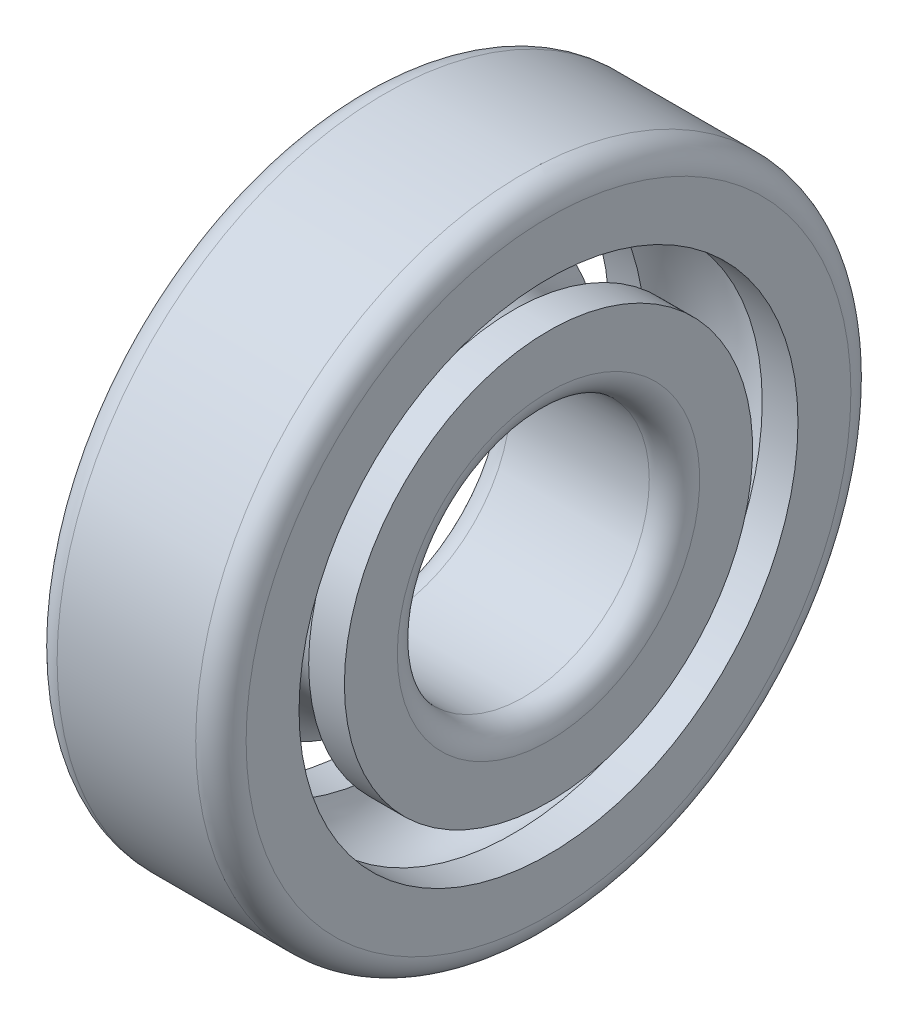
ISO-10303-21;
HEADER;
FILE_DESCRIPTION(('STEP AP214'),'2;1');
FILE_NAME('part.step','',(''),(''),'','','');
FILE_SCHEMA(('AUTOMOTIVE_DESIGN { 1 0 10303 214 1 1 1 1 }'));
ENDSEC;
DATA;
#1=APPLICATION_CONTEXT('core data for automotive mechanical design processes');
#2=APPLICATION_PROTOCOL_DEFINITION('international standard','automotive_design',2000,#1);
#3=PRODUCT_CONTEXT('',#1,'mechanical');
#4=PRODUCT('Part','Part','',(#3));
#5=PRODUCT_RELATED_PRODUCT_CATEGORY('part','',(#4));
#6=PRODUCT_DEFINITION_FORMATION('','',#4);
#7=PRODUCT_DEFINITION_CONTEXT('part definition',#1,'design');
#8=PRODUCT_DEFINITION('design','',#6,#7);
#9=PRODUCT_DEFINITION_SHAPE('','',#8);
#10=(LENGTH_UNIT() NAMED_UNIT(*) SI_UNIT(.MILLI.,.METRE.));
#11=(NAMED_UNIT(*) PLANE_ANGLE_UNIT() SI_UNIT($,.RADIAN.));
#12=(NAMED_UNIT(*) SI_UNIT($,.STERADIAN.) SOLID_ANGLE_UNIT());
#13=UNCERTAINTY_MEASURE_WITH_UNIT(LENGTH_MEASURE(1.E-05),#10,'distance_accuracy_value','');
#14=(GEOMETRIC_REPRESENTATION_CONTEXT(3) GLOBAL_UNCERTAINTY_ASSIGNED_CONTEXT((#13)) GLOBAL_UNIT_ASSIGNED_CONTEXT((#10,
#11,#12)) REPRESENTATION_CONTEXT('',''));
#15=CARTESIAN_POINT('',(0.,0.,0.));
#16=DIRECTION('',(0.,0.,1.));
#17=DIRECTION('',(1.,0.,0.));
#18=AXIS2_PLACEMENT_3D('',#15,#16,#17);
#19=CARTESIAN_POINT('',(2.74999999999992,0.,3.33066907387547E-13));
#20=DIRECTION('',(-1.,0.,0.));
#21=DIRECTION('',(0.,0.,1.));
#22=AXIS2_PLACEMENT_3D('',#19,#20,#21);
#23=TOROIDAL_SURFACE('',#22,12.,1.);
#24=CARTESIAN_POINT('',(2.74999999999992,0.,3.33066907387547E-13));
#25=DIRECTION('',(-1.,0.,0.));
#26=DIRECTION('',(0.,0.,1.));
#27=AXIS2_PLACEMENT_3D('',#24,#25,#26);
#28=CIRCLE('',#27,13.);
#29=CARTESIAN_POINT('',(2.74999999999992,0.,13.0000000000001));
#30=VERTEX_POINT('',#29);
#31=EDGE_CURVE('E11',#30,#30,#28,.T.);
#32=ORIENTED_EDGE('',*,*,#31,.F.);
#33=EDGE_LOOP('',(#32));
#34=FACE_BOUND('',#33,.T.);
#35=CARTESIAN_POINT('',(3.74999999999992,-1.11022302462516E-13,2.22044604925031E-13));
#36=DIRECTION('',(-1.,0.,0.));
#37=DIRECTION('',(0.,0.,1.));
#38=AXIS2_PLACEMENT_3D('',#35,#36,#37);
#39=CIRCLE('',#38,12.);
#40=CARTESIAN_POINT('',(3.74999999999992,-1.11224614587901E-13,12.0000000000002));
#41=VERTEX_POINT('',#40);
#42=EDGE_CURVE('E64',#41,#41,#39,.T.);
#43=ORIENTED_EDGE('',*,*,#42,.T.);
#44=EDGE_LOOP('',(#43));
#45=FACE_BOUND('',#44,.T.);
#46=ADVANCED_FACE('F36',(#34,#45),#23,.T.);
#47=CARTESIAN_POINT('',(-1.26513430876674,0.,1.11022302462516E-13));
#48=DIRECTION('',(-1.,0.,0.));
#49=DIRECTION('',(0.,0.,1.));
#50=AXIS2_PLACEMENT_3D('',#47,#48,#49);
#51=CYLINDRICAL_SURFACE('',#50,13.);
#52=CARTESIAN_POINT('',(-2.75000000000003,0.,1.11022302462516E-13));
#53=DIRECTION('',(-1.,0.,0.));
#54=DIRECTION('',(0.,0.,1.));
#55=AXIS2_PLACEMENT_3D('',#52,#53,#54);
#56=CIRCLE('',#55,13.);
#57=CARTESIAN_POINT('',(-2.75000000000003,0.,13.0000000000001));
#58=VERTEX_POINT('',#57);
#59=EDGE_CURVE('E42',#58,#58,#56,.T.);
#60=CARTESIAN_POINT('',(-2.75000000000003,0.,13.0000000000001));
#61=CARTESIAN_POINT('',(-2.69270833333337,0.,13.0000000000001));
#62=CARTESIAN_POINT('',(-2.6354166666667,0.,13.0000000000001));
#63=CARTESIAN_POINT('',(-2.52083333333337,0.,13.0000000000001));
#64=CARTESIAN_POINT('',(-2.4635416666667,0.,13.0000000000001));
#65=CARTESIAN_POINT('',(-2.34895833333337,0.,13.0000000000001));
#66=CARTESIAN_POINT('',(-2.2916666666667,0.,13.0000000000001));
#67=CARTESIAN_POINT('',(-2.17708333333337,0.,13.0000000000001));
#68=CARTESIAN_POINT('',(-2.1197916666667,0.,13.0000000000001));
#69=CARTESIAN_POINT('',(-2.00520833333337,0.,13.0000000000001));
#70=CARTESIAN_POINT('',(-1.94791666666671,0.,13.0000000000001));
#71=CARTESIAN_POINT('',(-1.83333333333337,0.,13.0000000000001));
#72=CARTESIAN_POINT('',(-1.77604166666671,0.,13.0000000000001));
#73=CARTESIAN_POINT('',(-1.66145833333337,0.,13.0000000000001));
#74=CARTESIAN_POINT('',(-1.60416666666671,0.,13.0000000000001));
#75=CARTESIAN_POINT('',(-1.48958333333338,0.,13.0000000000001));
#76=CARTESIAN_POINT('',(-1.43229166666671,0.,13.0000000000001));
#77=CARTESIAN_POINT('',(-1.31770833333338,0.,13.0000000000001));
#78=CARTESIAN_POINT('',(-1.26041666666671,0.,13.0000000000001));
#79=CARTESIAN_POINT('',(-1.14583333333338,0.,13.0000000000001));
#80=CARTESIAN_POINT('',(-1.08854166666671,0.,13.0000000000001));
#81=CARTESIAN_POINT('',(-0.973958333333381,0.,13.0000000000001));
#82=CARTESIAN_POINT('',(-0.916666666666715,0.,13.0000000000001));
#83=CARTESIAN_POINT('',(-0.802083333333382,0.,13.0000000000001));
#84=CARTESIAN_POINT('',(-0.744791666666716,0.,13.0000000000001));
#85=CARTESIAN_POINT('',(-0.630208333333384,0.,13.0000000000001));
#86=CARTESIAN_POINT('',(-0.572916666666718,0.,13.0000000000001));
#87=CARTESIAN_POINT('',(-0.458333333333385,0.,13.0000000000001));
#88=CARTESIAN_POINT('',(-0.401041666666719,0.,13.0000000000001));
#89=CARTESIAN_POINT('',(-0.286458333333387,0.,13.0000000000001));
#90=CARTESIAN_POINT('',(-0.229166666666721,0.,13.0000000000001));
#91=CARTESIAN_POINT('',(-0.114583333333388,0.,13.0000000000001));
#92=CARTESIAN_POINT('',(-0.0572916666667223,0.,13.0000000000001));
#93=CARTESIAN_POINT('',(0.05729166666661,0.,13.0000000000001));
#94=CARTESIAN_POINT('',(0.114583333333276,0.,13.0000000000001));
#95=CARTESIAN_POINT('',(0.229166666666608,0.,13.0000000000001));
#96=CARTESIAN_POINT('',(0.286458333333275,0.,13.0000000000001));
#97=CARTESIAN_POINT('',(0.401041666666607,0.,13.0000000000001));
#98=CARTESIAN_POINT('',(0.458333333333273,0.,13.0000000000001));
#99=CARTESIAN_POINT('',(0.572916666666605,0.,13.0000000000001));
#100=CARTESIAN_POINT('',(0.630208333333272,0.,13.0000000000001));
#101=CARTESIAN_POINT('',(0.744791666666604,0.,13.0000000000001));
#102=CARTESIAN_POINT('',(0.80208333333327,0.,13.0000000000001));
#103=CARTESIAN_POINT('',(0.916666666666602,0.,13.0000000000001));
#104=CARTESIAN_POINT('',(0.973958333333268,0.,13.0000000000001));
#105=CARTESIAN_POINT('',(1.0885416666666,0.,13.0000000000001));
#106=CARTESIAN_POINT('',(1.14583333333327,0.,13.0000000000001));
#107=CARTESIAN_POINT('',(1.2604166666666,0.,13.0000000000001));
#108=CARTESIAN_POINT('',(1.31770833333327,0.,13.0000000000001));
#109=CARTESIAN_POINT('',(1.4322916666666,0.,13.0000000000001));
#110=CARTESIAN_POINT('',(1.48958333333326,0.,13.0000000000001));
#111=CARTESIAN_POINT('',(1.6041666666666,0.,13.0000000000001));
#112=CARTESIAN_POINT('',(1.66145833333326,0.,13.0000000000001));
#113=CARTESIAN_POINT('',(1.77604166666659,0.,13.0000000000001));
#114=CARTESIAN_POINT('',(1.83333333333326,0.,13.0000000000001));
#115=CARTESIAN_POINT('',(1.94791666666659,0.,13.0000000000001));
#116=CARTESIAN_POINT('',(2.00520833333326,0.,13.0000000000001));
#117=CARTESIAN_POINT('',(2.11979166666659,0.,13.0000000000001));
#118=CARTESIAN_POINT('',(2.17708333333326,0.,13.0000000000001));
#119=CARTESIAN_POINT('',(2.29166666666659,0.,13.0000000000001));
#120=CARTESIAN_POINT('',(2.34895833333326,0.,13.0000000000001));
#121=CARTESIAN_POINT('',(2.46354166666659,0.,13.0000000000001));
#122=CARTESIAN_POINT('',(2.52083333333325,0.,13.0000000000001));
#123=CARTESIAN_POINT('',(2.63541666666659,0.,13.0000000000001));
#124=CARTESIAN_POINT('',(2.69270833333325,0.,13.0000000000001));
#125=CARTESIAN_POINT('',(2.74999999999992,0.,13.0000000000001));
#126=B_SPLINE_CURVE_WITH_KNOTS('',3,(#60,#61,#62,#63,#64,#65,#66,#67,#68,#69,#70,#71,#72,#73,
#74,#75,#76,#77,#78,#79,#80,#81,#82,#83,#84,#85,#86,#87,#88,#89,#90,#91,#92,#93,#94,#95,#96,#97,
#98,#99,#100,#101,#102,#103,#104,#105,#106,#107,#108,#109,#110,#111,#112,#113,#114,#115,#116,
#117,#118,#119,#120,#121,#122,#123,#124,#125),.UNSPECIFIED.,.F.,.F.,(4,2,2,2,2,2,2,2,2,2,2,2,2,
2,2,2,2,2,2,2,2,2,2,2,2,2,2,2,2,2,2,2,4),(0.,0.171874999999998,0.343749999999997,
0.515624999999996,0.687499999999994,0.859374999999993,1.03124999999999,1.20312499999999,
1.37499999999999,1.54687499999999,1.71874999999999,1.89062499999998,2.06249999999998,
2.23437499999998,2.40624999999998,2.57812499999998,2.74999999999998,2.92187499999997,
3.09374999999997,3.26562499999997,3.43749999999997,3.60937499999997,3.78124999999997,
3.95312499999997,4.12499999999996,4.29687499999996,4.46874999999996,4.64062499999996,
4.81249999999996,4.98437499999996,5.15624999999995,5.32812499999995,5.49999999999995),.UNSPECIFIED.);
#127=EDGE_CURVE('BSEAM101',#58,#30,#126,.T.);
#128=ORIENTED_EDGE('',*,*,#59,.F.);
#129=ORIENTED_EDGE('',*,*,#31,.T.);
#130=ORIENTED_EDGE('',*,*,#127,.T.);
#131=ORIENTED_EDGE('',*,*,#127,.F.);
#132=EDGE_LOOP('',(#128,#130,#129,#131));
#133=FACE_BOUND('',#132,.T.);
#134=ADVANCED_FACE('F101',(#133),#51,.T.);
#135=CARTESIAN_POINT('',(-2.75000000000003,0.,1.11022302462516E-13));
#136=DIRECTION('',(-1.,0.,0.));
#137=DIRECTION('',(0.,0.,1.));
#138=AXIS2_PLACEMENT_3D('',#135,#136,#137);
#139=TOROIDAL_SURFACE('',#138,12.,1.);
#140=CARTESIAN_POINT('',(-3.74999999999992,0.,1.11022302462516E-13));
#141=DIRECTION('',(-1.,0.,0.));
#142=DIRECTION('',(0.,0.,1.));
#143=AXIS2_PLACEMENT_3D('',#140,#141,#142);
#144=CIRCLE('',#143,12.);
#145=CARTESIAN_POINT('',(-3.74999999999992,0.,12.0000000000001));
#146=VERTEX_POINT('',#145);
#147=EDGE_CURVE('E46',#146,#146,#144,.T.);
#148=ORIENTED_EDGE('',*,*,#147,.F.);
#149=EDGE_LOOP('',(#148));
#150=FACE_BOUND('',#149,.T.);
#151=ORIENTED_EDGE('',*,*,#59,.T.);
#152=EDGE_LOOP('',(#151));
#153=FACE_BOUND('',#152,.T.);
#154=ADVANCED_FACE('F96',(#150,#153),#139,.T.);
#155=CARTESIAN_POINT('',(-3.75000000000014,0.,-12.));
#156=DIRECTION('',(1.,0.,0.));
#157=DIRECTION('',(0.,0.,-1.));
#158=AXIS2_PLACEMENT_3D('',#155,#156,#157);
#159=PLANE('',#158);
#160=CARTESIAN_POINT('',(-3.74999999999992,0.,1.11022302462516E-13));
#161=DIRECTION('',(-1.,0.,0.));
#162=DIRECTION('',(0.,0.,1.));
#163=AXIS2_PLACEMENT_3D('',#160,#161,#162);
#164=CIRCLE('',#163,9.9);
#165=CARTESIAN_POINT('',(-3.74999999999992,0.,9.90000000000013));
#166=VERTEX_POINT('',#165);
#167=EDGE_CURVE('E50',#166,#166,#164,.T.);
#168=ORIENTED_EDGE('',*,*,#167,.F.);
#169=EDGE_LOOP('',(#168));
#170=FACE_BOUND('',#169,.T.);
#171=ORIENTED_EDGE('',*,*,#147,.T.);
#172=EDGE_LOOP('',(#171));
#173=FACE_BOUND('',#172,.T.);
#174=ADVANCED_FACE('F90',(#170,#173),#159,.F.);
#175=CARTESIAN_POINT('',(-1.26513430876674,0.,1.11022302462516E-13));
#176=DIRECTION('',(-1.,0.,0.));
#177=DIRECTION('',(0.,0.,1.));
#178=AXIS2_PLACEMENT_3D('',#175,#176,#177);
#179=CYLINDRICAL_SURFACE('',#178,9.9);
#180=CARTESIAN_POINT('',(-2.33238075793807,0.,2.22044604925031E-13));
#181=DIRECTION('',(-1.,0.,0.));
#182=DIRECTION('',(0.,0.,1.));
#183=AXIS2_PLACEMENT_3D('',#180,#181,#182);
#184=CIRCLE('',#183,9.9);
#185=CARTESIAN_POINT('',(-2.33238075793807,0.,9.90000000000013));
#186=VERTEX_POINT('',#185);
#187=EDGE_CURVE('E55',#186,#186,#184,.T.);
#188=CARTESIAN_POINT('',(-2.33238075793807,0.,9.90000000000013));
#189=CARTESIAN_POINT('',(-2.34714762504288,0.,9.90000000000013));
#190=CARTESIAN_POINT('',(-2.36191449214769,0.,9.90000000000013));
#191=CARTESIAN_POINT('',(-2.39144822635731,0.,9.90000000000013));
#192=CARTESIAN_POINT('',(-2.40621509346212,0.,9.90000000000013));
#193=CARTESIAN_POINT('',(-2.43574882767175,0.,9.90000000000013));
#194=CARTESIAN_POINT('',(-2.45051569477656,0.,9.90000000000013));
#195=CARTESIAN_POINT('',(-2.48004942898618,0.,9.90000000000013));
#196=CARTESIAN_POINT('',(-2.49481629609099,0.,9.90000000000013));
#197=CARTESIAN_POINT('',(-2.52435003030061,0.,9.90000000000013));
#198=CARTESIAN_POINT('',(-2.53911689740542,0.,9.90000000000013));
#199=CARTESIAN_POINT('',(-2.56865063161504,0.,9.90000000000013));
#200=CARTESIAN_POINT('',(-2.58341749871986,0.,9.90000000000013));
#201=CARTESIAN_POINT('',(-2.61295123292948,0.,9.90000000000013));
#202=CARTESIAN_POINT('',(-2.62771810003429,0.,9.90000000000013));
#203=CARTESIAN_POINT('',(-2.65725183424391,0.,9.90000000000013));
#204=CARTESIAN_POINT('',(-2.67201870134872,0.,9.90000000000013));
#205=CARTESIAN_POINT('',(-2.70155243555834,0.,9.90000000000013));
#206=CARTESIAN_POINT('',(-2.71631930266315,0.,9.90000000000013));
#207=CARTESIAN_POINT('',(-2.74585303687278,0.,9.90000000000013));
#208=CARTESIAN_POINT('',(-2.76061990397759,0.,9.90000000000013));
#209=CARTESIAN_POINT('',(-2.79015363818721,0.,9.90000000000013));
#210=CARTESIAN_POINT('',(-2.80492050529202,0.,9.90000000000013));
#211=CARTESIAN_POINT('',(-2.83445423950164,0.,9.90000000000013));
#212=CARTESIAN_POINT('',(-2.84922110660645,0.,9.90000000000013));
#213=CARTESIAN_POINT('',(-2.87875484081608,0.,9.90000000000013));
#214=CARTESIAN_POINT('',(-2.89352170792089,0.,9.90000000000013));
#215=CARTESIAN_POINT('',(-2.92305544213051,0.,9.90000000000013));
#216=CARTESIAN_POINT('',(-2.93782230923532,0.,9.90000000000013));
#217=CARTESIAN_POINT('',(-2.96735604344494,0.,9.90000000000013));
#218=CARTESIAN_POINT('',(-2.98212291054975,0.,9.90000000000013));
#219=CARTESIAN_POINT('',(-3.01165664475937,0.,9.90000000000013));
#220=CARTESIAN_POINT('',(-3.02642351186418,0.,9.90000000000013));
#221=CARTESIAN_POINT('',(-3.05595724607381,0.,9.90000000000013));
#222=CARTESIAN_POINT('',(-3.07072411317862,0.,9.90000000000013));
#223=CARTESIAN_POINT('',(-3.10025784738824,0.,9.90000000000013));
#224=CARTESIAN_POINT('',(-3.11502471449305,0.,9.90000000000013));
#225=CARTESIAN_POINT('',(-3.14455844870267,0.,9.90000000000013));
#226=CARTESIAN_POINT('',(-3.15932531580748,0.,9.90000000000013));
#227=CARTESIAN_POINT('',(-3.1888590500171,0.,9.90000000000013));
#228=CARTESIAN_POINT('',(-3.20362591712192,0.,9.90000000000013));
#229=CARTESIAN_POINT('',(-3.23315965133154,0.,9.90000000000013));
#230=CARTESIAN_POINT('',(-3.24792651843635,0.,9.90000000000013));
#231=CARTESIAN_POINT('',(-3.27746025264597,0.,9.90000000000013));
#232=CARTESIAN_POINT('',(-3.29222711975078,0.,9.90000000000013));
#233=CARTESIAN_POINT('',(-3.3217608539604,0.,9.90000000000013));
#234=CARTESIAN_POINT('',(-3.33652772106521,0.,9.90000000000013));
#235=CARTESIAN_POINT('',(-3.36606145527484,0.,9.90000000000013));
#236=CARTESIAN_POINT('',(-3.38082832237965,0.,9.90000000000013));
#237=CARTESIAN_POINT('',(-3.41036205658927,0.,9.90000000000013));
#238=CARTESIAN_POINT('',(-3.42512892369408,0.,9.90000000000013));
#239=CARTESIAN_POINT('',(-3.4546626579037,0.,9.90000000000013));
#240=CARTESIAN_POINT('',(-3.46942952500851,0.,9.90000000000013));
#241=CARTESIAN_POINT('',(-3.49896325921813,0.,9.90000000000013));
#242=CARTESIAN_POINT('',(-3.51373012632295,0.,9.90000000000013));
#243=CARTESIAN_POINT('',(-3.54326386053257,0.,9.90000000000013));
#244=CARTESIAN_POINT('',(-3.55803072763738,0.,9.90000000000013));
#245=CARTESIAN_POINT('',(-3.587564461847,0.,9.90000000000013));
#246=CARTESIAN_POINT('',(-3.60233132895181,0.,9.90000000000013));
#247=CARTESIAN_POINT('',(-3.63186506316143,0.,9.90000000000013));
#248=CARTESIAN_POINT('',(-3.64663193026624,0.,9.90000000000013));
#249=CARTESIAN_POINT('',(-3.67616566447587,0.,9.90000000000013));
#250=CARTESIAN_POINT('',(-3.69093253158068,0.,9.90000000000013));
#251=CARTESIAN_POINT('',(-3.7204662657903,0.,9.90000000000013));
#252=CARTESIAN_POINT('',(-3.73523313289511,0.,9.90000000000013));
#253=CARTESIAN_POINT('',(-3.74999999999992,0.,9.90000000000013));
#254=B_SPLINE_CURVE_WITH_KNOTS('',3,(#188,#189,#190,#191,#192,#193,#194,#195,#196,#197,#198,
#199,#200,#201,#202,#203,#204,#205,#206,#207,#208,#209,#210,#211,#212,#213,#214,#215,#216,#217,
#218,#219,#220,#221,#222,#223,#224,#225,#226,#227,#228,#229,#230,#231,#232,#233,#234,#235,#236,
#237,#238,#239,#240,#241,#242,#243,#244,#245,#246,#247,#248,#249,#250,#251,#252,#253),
.UNSPECIFIED.,.F.,.F.,(4,2,2,2,2,2,2,2,2,2,2,2,2,2,2,2,2,2,2,2,2,2,2,2,2,2,2,2,2,2,2,2,4),(0.,
0.0443006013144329,0.0886012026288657,0.132901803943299,0.177202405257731,0.221503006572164,
0.265803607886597,0.31010420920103,0.354404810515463,0.398705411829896,0.443006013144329,
0.487306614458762,0.531607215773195,0.575907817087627,0.62020841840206,0.664509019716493,
0.708809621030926,0.753110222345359,0.797410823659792,0.841711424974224,0.886012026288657,
0.93031262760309,0.974613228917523,1.01891383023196,1.06321443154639,1.10751503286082,
1.15181563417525,1.19611623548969,1.24041683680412,1.28471743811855,1.32901803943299,
1.37331864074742,1.41761924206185),.UNSPECIFIED.);
#255=EDGE_CURVE('BSEAM84',#186,#166,#254,.T.);
#256=ORIENTED_EDGE('',*,*,#187,.F.);
#257=ORIENTED_EDGE('',*,*,#167,.T.);
#258=ORIENTED_EDGE('',*,*,#255,.T.);
#259=ORIENTED_EDGE('',*,*,#255,.F.);
#260=EDGE_LOOP('',(#256,#258,#257,#259));
#261=FACE_BOUND('',#260,.T.);
#262=ADVANCED_FACE('F84',(#261),#179,.F.);
#263=CARTESIAN_POINT('',(0.,0.,0.));
#264=DIRECTION('',(-1.,0.,0.));
#265=DIRECTION('',(0.,0.,1.));
#266=AXIS2_PLACEMENT_3D('',#263,#264,#265);
#267=TOROIDAL_SURFACE('',#266,9.,2.5);
#268=CARTESIAN_POINT('',(2.33238075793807,1.11022302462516E-13,-1.11022302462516E-13));
#269=DIRECTION('',(-1.,0.,0.));
#270=DIRECTION('',(0.,0.,1.));
#271=AXIS2_PLACEMENT_3D('',#268,#269,#270);
#272=CIRCLE('',#271,9.9);
#273=CARTESIAN_POINT('',(2.33238075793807,0.,9.90000000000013));
#274=VERTEX_POINT('',#273);
#275=EDGE_CURVE('E58',#274,#274,#272,.T.);
#276=ORIENTED_EDGE('',*,*,#275,.F.);
#277=EDGE_LOOP('',(#276));
#278=FACE_BOUND('',#277,.T.);
#279=ORIENTED_EDGE('',*,*,#187,.T.);
#280=EDGE_LOOP('',(#279));
#281=FACE_BOUND('',#280,.T.);
#282=ADVANCED_FACE('F78',(#278,#281),#267,.F.);
#283=CARTESIAN_POINT('',(-1.26513430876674,0.,1.11022302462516E-13));
#284=DIRECTION('',(-1.,0.,0.));
#285=DIRECTION('',(0.,0.,1.));
#286=AXIS2_PLACEMENT_3D('',#283,#284,#285);
#287=CYLINDRICAL_SURFACE('',#286,9.9);
#288=CARTESIAN_POINT('',(3.74999999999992,-1.11022302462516E-13,2.22044604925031E-13));
#289=DIRECTION('',(-1.,0.,0.));
#290=DIRECTION('',(0.,0.,1.));
#291=AXIS2_PLACEMENT_3D('',#288,#289,#290);
#292=CIRCLE('',#291,9.9);
#293=CARTESIAN_POINT('',(3.74999999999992,0.,9.90000000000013));
#294=VERTEX_POINT('',#293);
#295=EDGE_CURVE('E61',#294,#294,#292,.T.);
#296=CARTESIAN_POINT('',(3.74999999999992,0.,9.90000000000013));
#297=CARTESIAN_POINT('',(3.73523313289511,0.,9.90000000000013));
#298=CARTESIAN_POINT('',(3.7204662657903,0.,9.90000000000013));
#299=CARTESIAN_POINT('',(3.69093253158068,0.,9.90000000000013));
#300=CARTESIAN_POINT('',(3.67616566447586,0.,9.90000000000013));
#301=CARTESIAN_POINT('',(3.64663193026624,0.,9.90000000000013));
#302=CARTESIAN_POINT('',(3.63186506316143,0.,9.90000000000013));
#303=CARTESIAN_POINT('',(3.60233132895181,0.,9.90000000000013));
#304=CARTESIAN_POINT('',(3.587564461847,0.,9.90000000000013));
#305=CARTESIAN_POINT('',(3.55803072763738,0.,9.90000000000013));
#306=CARTESIAN_POINT('',(3.54326386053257,0.,9.90000000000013));
#307=CARTESIAN_POINT('',(3.51373012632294,0.,9.90000000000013));
#308=CARTESIAN_POINT('',(3.49896325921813,0.,9.90000000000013));
#309=CARTESIAN_POINT('',(3.46942952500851,0.,9.90000000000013));
#310=CARTESIAN_POINT('',(3.4546626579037,0.,9.90000000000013));
#311=CARTESIAN_POINT('',(3.42512892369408,0.,9.90000000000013));
#312=CARTESIAN_POINT('',(3.41036205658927,0.,9.90000000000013));
#313=CARTESIAN_POINT('',(3.38082832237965,0.,9.90000000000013));
#314=CARTESIAN_POINT('',(3.36606145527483,0.,9.90000000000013));
#315=CARTESIAN_POINT('',(3.33652772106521,0.,9.90000000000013));
#316=CARTESIAN_POINT('',(3.3217608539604,0.,9.90000000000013));
#317=CARTESIAN_POINT('',(3.29222711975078,0.,9.90000000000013));
#318=CARTESIAN_POINT('',(3.27746025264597,0.,9.90000000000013));
#319=CARTESIAN_POINT('',(3.24792651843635,0.,9.90000000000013));
#320=CARTESIAN_POINT('',(3.23315965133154,0.,9.90000000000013));
#321=CARTESIAN_POINT('',(3.20362591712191,0.,9.90000000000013));
#322=CARTESIAN_POINT('',(3.1888590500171,0.,9.90000000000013));
#323=CARTESIAN_POINT('',(3.15932531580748,0.,9.90000000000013));
#324=CARTESIAN_POINT('',(3.14455844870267,0.,9.90000000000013));
#325=CARTESIAN_POINT('',(3.11502471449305,0.,9.90000000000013));
#326=CARTESIAN_POINT('',(3.10025784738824,0.,9.90000000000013));
#327=CARTESIAN_POINT('',(3.07072411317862,0.,9.90000000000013));
#328=CARTESIAN_POINT('',(3.0559572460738,0.,9.90000000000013));
#329=CARTESIAN_POINT('',(3.02642351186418,0.,9.90000000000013));
#330=CARTESIAN_POINT('',(3.01165664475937,0.,9.90000000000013));
#331=CARTESIAN_POINT('',(2.98212291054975,0.,9.90000000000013));
#332=CARTESIAN_POINT('',(2.96735604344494,0.,9.90000000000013));
#333=CARTESIAN_POINT('',(2.93782230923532,0.,9.90000000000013));
#334=CARTESIAN_POINT('',(2.92305544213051,0.,9.90000000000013));
#335=CARTESIAN_POINT('',(2.89352170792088,0.,9.90000000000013));
#336=CARTESIAN_POINT('',(2.87875484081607,0.,9.90000000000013));
#337=CARTESIAN_POINT('',(2.84922110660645,0.,9.90000000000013));
#338=CARTESIAN_POINT('',(2.83445423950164,0.,9.90000000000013));
#339=CARTESIAN_POINT('',(2.80492050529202,0.,9.90000000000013));
#340=CARTESIAN_POINT('',(2.79015363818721,0.,9.90000000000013));
#341=CARTESIAN_POINT('',(2.76061990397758,0.,9.90000000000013));
#342=CARTESIAN_POINT('',(2.74585303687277,0.,9.90000000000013));
#343=CARTESIAN_POINT('',(2.71631930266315,0.,9.90000000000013));
#344=CARTESIAN_POINT('',(2.70155243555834,0.,9.90000000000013));
#345=CARTESIAN_POINT('',(2.67201870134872,0.,9.90000000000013));
#346=CARTESIAN_POINT('',(2.65725183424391,0.,9.90000000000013));
#347=CARTESIAN_POINT('',(2.62771810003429,0.,9.90000000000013));
#348=CARTESIAN_POINT('',(2.61295123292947,0.,9.90000000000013));
#349=CARTESIAN_POINT('',(2.58341749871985,0.,9.90000000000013));
#350=CARTESIAN_POINT('',(2.56865063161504,0.,9.90000000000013));
#351=CARTESIAN_POINT('',(2.53911689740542,0.,9.90000000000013));
#352=CARTESIAN_POINT('',(2.52435003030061,0.,9.90000000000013));
#353=CARTESIAN_POINT('',(2.49481629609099,0.,9.90000000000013));
#354=CARTESIAN_POINT('',(2.48004942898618,0.,9.90000000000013));
#355=CARTESIAN_POINT('',(2.45051569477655,0.,9.90000000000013));
#356=CARTESIAN_POINT('',(2.43574882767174,0.,9.90000000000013));
#357=CARTESIAN_POINT('',(2.40621509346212,0.,9.90000000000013));
#358=CARTESIAN_POINT('',(2.39144822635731,0.,9.90000000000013));
#359=CARTESIAN_POINT('',(2.36191449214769,0.,9.90000000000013));
#360=CARTESIAN_POINT('',(2.34714762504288,0.,9.90000000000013));
#361=CARTESIAN_POINT('',(2.33238075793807,0.,9.90000000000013));
#362=B_SPLINE_CURVE_WITH_KNOTS('',3,(#296,#297,#298,#299,#300,#301,#302,#303,#304,#305,#306,
#307,#308,#309,#310,#311,#312,#313,#314,#315,#316,#317,#318,#319,#320,#321,#322,#323,#324,#325,
#326,#327,#328,#329,#330,#331,#332,#333,#334,#335,#336,#337,#338,#339,#340,#341,#342,#343,#344,
#345,#346,#347,#348,#349,#350,#351,#352,#353,#354,#355,#356,#357,#358,#359,#360,#361),
.UNSPECIFIED.,.F.,.F.,(4,2,2,2,2,2,2,2,2,2,2,2,2,2,2,2,2,2,2,2,2,2,2,2,2,2,2,2,2,2,2,2,4),(0.,
0.0443006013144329,0.0886012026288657,0.132901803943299,0.177202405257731,0.221503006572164,
0.265803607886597,0.31010420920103,0.354404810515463,0.398705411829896,0.443006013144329,
0.487306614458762,0.531607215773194,0.575907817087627,0.62020841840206,0.664509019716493,
0.708809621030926,0.753110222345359,0.797410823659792,0.841711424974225,0.886012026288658,
0.930312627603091,0.974613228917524,1.01891383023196,1.06321443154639,1.10751503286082,
1.15181563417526,1.19611623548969,1.24041683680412,1.28471743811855,1.32901803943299,
1.37331864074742,1.41761924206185),.UNSPECIFIED.);
#363=EDGE_CURVE('BSEAM72',#294,#274,#362,.T.);
#364=ORIENTED_EDGE('',*,*,#295,.F.);
#365=ORIENTED_EDGE('',*,*,#275,.T.);
#366=ORIENTED_EDGE('',*,*,#363,.T.);
#367=ORIENTED_EDGE('',*,*,#363,.F.);
#368=EDGE_LOOP('',(#364,#366,#365,#367));
#369=FACE_BOUND('',#368,.T.);
#370=ADVANCED_FACE('F72',(#369),#287,.F.);
#371=CARTESIAN_POINT('',(3.74999999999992,-1.11022302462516E-13,-9.89999999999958));
#372=DIRECTION('',(-1.,0.,0.));
#373=DIRECTION('',(0.,0.,1.));
#374=AXIS2_PLACEMENT_3D('',#371,#372,#373);
#375=PLANE('',#374);
#376=ORIENTED_EDGE('',*,*,#42,.F.);
#377=EDGE_LOOP('',(#376));
#378=FACE_BOUND('',#377,.T.);
#379=ORIENTED_EDGE('',*,*,#295,.T.);
#380=EDGE_LOOP('',(#379));
#381=FACE_BOUND('',#380,.T.);
#382=ADVANCED_FACE('F69',(#378,#381),#375,.F.);
#383=CLOSED_SHELL('',(#46,#134,#154,#174,#262,#282,#370,#382));
#384=MANIFOLD_SOLID_BREP('B2',#383);
#385=CARTESIAN_POINT('',(-2.74999999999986,0.,0.));
#386=DIRECTION('',(-1.,0.,0.));
#387=DIRECTION('',(0.,0.,1.));
#388=AXIS2_PLACEMENT_3D('',#385,#386,#387);
#389=TOROIDAL_SURFACE('',#388,6.,1.);
#390=CARTESIAN_POINT('',(-2.74999999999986,0.,0.));
#391=DIRECTION('',(-1.,0.,0.));
#392=DIRECTION('',(0.,0.,1.));
#393=AXIS2_PLACEMENT_3D('',#390,#391,#392);
#394=CIRCLE('',#393,5.);
#395=CARTESIAN_POINT('',(-2.74999999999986,0.,5.00000000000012));
#396=VERTEX_POINT('',#395);
#397=EDGE_CURVE('E169',#396,#396,#394,.T.);
#398=ORIENTED_EDGE('',*,*,#397,.F.);
#399=EDGE_LOOP('',(#398));
#400=FACE_BOUND('',#399,.T.);
#401=CARTESIAN_POINT('',(-3.74999999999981,0.,-1.11022302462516E-13));
#402=DIRECTION('',(-1.,0.,0.));
#403=DIRECTION('',(0.,0.,1.));
#404=AXIS2_PLACEMENT_3D('',#401,#402,#403);
#405=CIRCLE('',#404,6.00000000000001);
#406=CARTESIAN_POINT('',(-3.74999999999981,0.,5.99999999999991));
#407=VERTEX_POINT('',#406);
#408=EDGE_CURVE('E35',#407,#407,#405,.T.);
#409=ORIENTED_EDGE('',*,*,#408,.T.);
#410=EDGE_LOOP('',(#409));
#411=FACE_BOUND('',#410,.T.);
#412=ADVANCED_FACE('F141',(#400,#411),#389,.T.);
#413=CARTESIAN_POINT('',(-3.75000000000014,0.,-8.09999999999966));
#414=DIRECTION('',(1.,0.,0.));
#415=DIRECTION('',(0.,0.,-1.));
#416=AXIS2_PLACEMENT_3D('',#413,#414,#415);
#417=PLANE('',#416);
#418=ORIENTED_EDGE('',*,*,#408,.F.);
#419=EDGE_LOOP('',(#418));
#420=FACE_BOUND('',#419,.T.);
#421=CARTESIAN_POINT('',(-3.74999999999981,0.,-1.11022302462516E-13));
#422=DIRECTION('',(-1.,0.,0.));
#423=DIRECTION('',(0.,0.,1.));
#424=AXIS2_PLACEMENT_3D('',#421,#422,#423);
#425=CIRCLE('',#424,8.1);
#426=CARTESIAN_POINT('',(-3.74999999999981,0.,8.10000000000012));
#427=VERTEX_POINT('',#426);
#428=EDGE_CURVE('E147',#427,#427,#425,.T.);
#429=ORIENTED_EDGE('',*,*,#428,.T.);
#430=EDGE_LOOP('',(#429));
#431=FACE_BOUND('',#430,.T.);
#432=ADVANCED_FACE('F176',(#420,#431),#417,.F.);
#433=CARTESIAN_POINT('',(-1.26513430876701,0.,1.11022302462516E-13));
#434=DIRECTION('',(-1.,0.,0.));
#435=DIRECTION('',(0.,0.,1.));
#436=AXIS2_PLACEMENT_3D('',#433,#434,#435);
#437=CYLINDRICAL_SURFACE('',#436,8.1);
#438=CARTESIAN_POINT('',(-2.33238075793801,0.,0.));
#439=DIRECTION('',(-1.,0.,0.));
#440=DIRECTION('',(0.,0.,1.));
#441=AXIS2_PLACEMENT_3D('',#438,#439,#440);
#442=CIRCLE('',#441,8.1);
#443=CARTESIAN_POINT('',(-2.33238075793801,0.,8.10000000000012));
#444=VERTEX_POINT('',#443);
#445=EDGE_CURVE('E151',#444,#444,#442,.T.);
#446=CARTESIAN_POINT('',(-3.74999999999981,0.,8.10000000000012));
#447=CARTESIAN_POINT('',(-3.735233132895,0.,8.10000000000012));
#448=CARTESIAN_POINT('',(-3.72046626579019,0.,8.10000000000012));
#449=CARTESIAN_POINT('',(-3.69093253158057,0.,8.10000000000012));
#450=CARTESIAN_POINT('',(-3.67616566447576,0.,8.10000000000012));
#451=CARTESIAN_POINT('',(-3.64663193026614,0.,8.10000000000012));
#452=CARTESIAN_POINT('',(-3.63186506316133,0.,8.10000000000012));
#453=CARTESIAN_POINT('',(-3.60233132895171,0.,8.10000000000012));
#454=CARTESIAN_POINT('',(-3.5875644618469,0.,8.10000000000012));
#455=CARTESIAN_POINT('',(-3.55803072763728,0.,8.10000000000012));
#456=CARTESIAN_POINT('',(-3.54326386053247,0.,8.10000000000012));
#457=CARTESIAN_POINT('',(-3.51373012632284,0.,8.10000000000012));
#458=CARTESIAN_POINT('',(-3.49896325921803,0.,8.10000000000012));
#459=CARTESIAN_POINT('',(-3.46942952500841,0.,8.10000000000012));
#460=CARTESIAN_POINT('',(-3.4546626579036,0.,8.10000000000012));
#461=CARTESIAN_POINT('',(-3.42512892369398,0.,8.10000000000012));
#462=CARTESIAN_POINT('',(-3.41036205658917,0.,8.10000000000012));
#463=CARTESIAN_POINT('',(-3.38082832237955,0.,8.10000000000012));
#464=CARTESIAN_POINT('',(-3.36606145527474,0.,8.10000000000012));
#465=CARTESIAN_POINT('',(-3.33652772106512,0.,8.10000000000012));
#466=CARTESIAN_POINT('',(-3.32176085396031,0.,8.10000000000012));
#467=CARTESIAN_POINT('',(-3.29222711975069,0.,8.10000000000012));
#468=CARTESIAN_POINT('',(-3.27746025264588,0.,8.10000000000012));
#469=CARTESIAN_POINT('',(-3.24792651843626,0.,8.10000000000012));
#470=CARTESIAN_POINT('',(-3.23315965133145,0.,8.10000000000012));
#471=CARTESIAN_POINT('',(-3.20362591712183,0.,8.10000000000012));
#472=CARTESIAN_POINT('',(-3.18885905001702,0.,8.10000000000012));
#473=CARTESIAN_POINT('',(-3.15932531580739,0.,8.10000000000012));
#474=CARTESIAN_POINT('',(-3.14455844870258,0.,8.10000000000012));
#475=CARTESIAN_POINT('',(-3.11502471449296,0.,8.10000000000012));
#476=CARTESIAN_POINT('',(-3.10025784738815,0.,8.10000000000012));
#477=CARTESIAN_POINT('',(-3.07072411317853,0.,8.10000000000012));
#478=CARTESIAN_POINT('',(-3.05595724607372,0.,8.10000000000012));
#479=CARTESIAN_POINT('',(-3.0264235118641,0.,8.10000000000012));
#480=CARTESIAN_POINT('',(-3.01165664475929,0.,8.10000000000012));
#481=CARTESIAN_POINT('',(-2.98212291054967,0.,8.10000000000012));
#482=CARTESIAN_POINT('',(-2.96735604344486,0.,8.10000000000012));
#483=CARTESIAN_POINT('',(-2.93782230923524,0.,8.10000000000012));
#484=CARTESIAN_POINT('',(-2.92305544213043,0.,8.10000000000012));
#485=CARTESIAN_POINT('',(-2.89352170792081,0.,8.10000000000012));
#486=CARTESIAN_POINT('',(-2.878754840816,0.,8.10000000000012));
#487=CARTESIAN_POINT('',(-2.84922110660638,0.,8.10000000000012));
#488=CARTESIAN_POINT('',(-2.83445423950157,0.,8.10000000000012));
#489=CARTESIAN_POINT('',(-2.80492050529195,0.,8.10000000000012));
#490=CARTESIAN_POINT('',(-2.79015363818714,0.,8.10000000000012));
#491=CARTESIAN_POINT('',(-2.76061990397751,0.,8.10000000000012));
#492=CARTESIAN_POINT('',(-2.7458530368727,0.,8.10000000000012));
#493=CARTESIAN_POINT('',(-2.71631930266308,0.,8.10000000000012));
#494=CARTESIAN_POINT('',(-2.70155243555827,0.,8.10000000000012));
#495=CARTESIAN_POINT('',(-2.67201870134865,0.,8.10000000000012));
#496=CARTESIAN_POINT('',(-2.65725183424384,0.,8.10000000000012));
#497=CARTESIAN_POINT('',(-2.62771810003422,0.,8.10000000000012));
#498=CARTESIAN_POINT('',(-2.61295123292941,0.,8.10000000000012));
#499=CARTESIAN_POINT('',(-2.58341749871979,0.,8.10000000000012));
#500=CARTESIAN_POINT('',(-2.56865063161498,0.,8.10000000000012));
#501=CARTESIAN_POINT('',(-2.53911689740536,0.,8.10000000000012));
#502=CARTESIAN_POINT('',(-2.52435003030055,0.,8.10000000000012));
#503=CARTESIAN_POINT('',(-2.49481629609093,0.,8.10000000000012));
#504=CARTESIAN_POINT('',(-2.48004942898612,0.,8.10000000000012));
#505=CARTESIAN_POINT('',(-2.4505156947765,0.,8.10000000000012));
#506=CARTESIAN_POINT('',(-2.43574882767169,0.,8.10000000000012));
#507=CARTESIAN_POINT('',(-2.40621509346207,0.,8.10000000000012));
#508=CARTESIAN_POINT('',(-2.39144822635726,0.,8.10000000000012));
#509=CARTESIAN_POINT('',(-2.36191449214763,0.,8.10000000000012));
#510=CARTESIAN_POINT('',(-2.34714762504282,0.,8.10000000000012));
#511=CARTESIAN_POINT('',(-2.33238075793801,0.,8.10000000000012));
#512=B_SPLINE_CURVE_WITH_KNOTS('',3,(#446,#447,#448,#449,#450,#451,#452,#453,#454,#455,#456,
#457,#458,#459,#460,#461,#462,#463,#464,#465,#466,#467,#468,#469,#470,#471,#472,#473,#474,#475,
#476,#477,#478,#479,#480,#481,#482,#483,#484,#485,#486,#487,#488,#489,#490,#491,#492,#493,#494,
#495,#496,#497,#498,#499,#500,#501,#502,#503,#504,#505,#506,#507,#508,#509,#510,#511),
.UNSPECIFIED.,.F.,.F.,(4,2,2,2,2,2,2,2,2,2,2,2,2,2,2,2,2,2,2,2,2,2,2,2,2,2,2,2,2,2,2,2,4),(0.,
0.0443006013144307,0.0886012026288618,0.132901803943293,0.177202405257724,0.221503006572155,
0.265803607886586,0.310104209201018,0.354404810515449,0.39870541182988,0.443006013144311,
0.487306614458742,0.531607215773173,0.575907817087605,0.620208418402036,0.664509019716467,
0.708809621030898,0.753110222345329,0.79741082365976,0.841711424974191,0.886012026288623,
0.930312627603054,0.974613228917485,1.01891383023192,1.06321443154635,1.10751503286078,
1.15181563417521,1.19611623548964,1.24041683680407,1.2847174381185,1.32901803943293,
1.37331864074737,1.4176192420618),.UNSPECIFIED.);
#513=EDGE_CURVE('BSEAM180',#427,#444,#512,.T.);
#514=ORIENTED_EDGE('',*,*,#428,.F.);
#515=ORIENTED_EDGE('',*,*,#445,.T.);
#516=ORIENTED_EDGE('',*,*,#513,.T.);
#517=ORIENTED_EDGE('',*,*,#513,.F.);
#518=EDGE_LOOP('',(#514,#516,#515,#517));
#519=FACE_BOUND('',#518,.T.);
#520=ADVANCED_FACE('F180',(#519),#437,.T.);
#521=CARTESIAN_POINT('',(0.,0.,0.));
#522=DIRECTION('',(-1.,0.,0.));
#523=DIRECTION('',(0.,0.,1.));
#524=AXIS2_PLACEMENT_3D('',#521,#522,#523);
#525=TOROIDAL_SURFACE('',#524,9.,2.5);
#526=ORIENTED_EDGE('',*,*,#445,.F.);
#527=EDGE_LOOP('',(#526));
#528=FACE_BOUND('',#527,.T.);
#529=CARTESIAN_POINT('',(2.33238075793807,2.77555756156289E-13,1.11022302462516E-13));
#530=DIRECTION('',(-1.,0.,0.));
#531=DIRECTION('',(0.,0.,1.));
#532=AXIS2_PLACEMENT_3D('',#529,#530,#531);
#533=CIRCLE('',#532,8.1);
#534=CARTESIAN_POINT('',(2.33238075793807,0.,8.10000000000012));
#535=VERTEX_POINT('',#534);
#536=EDGE_CURVE('E155',#535,#535,#533,.T.);
#537=ORIENTED_EDGE('',*,*,#536,.T.);
#538=EDGE_LOOP('',(#537));
#539=FACE_BOUND('',#538,.T.);
#540=ADVANCED_FACE('F185',(#528,#539),#525,.F.);
#541=CARTESIAN_POINT('',(-1.26513430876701,0.,1.11022302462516E-13));
#542=DIRECTION('',(-1.,0.,0.));
#543=DIRECTION('',(0.,0.,1.));
#544=AXIS2_PLACEMENT_3D('',#541,#542,#543);
#545=CYLINDRICAL_SURFACE('',#544,8.1);
#546=CARTESIAN_POINT('',(3.74999999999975,0.,1.11022302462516E-13));
#547=DIRECTION('',(-1.,0.,0.));
#548=DIRECTION('',(0.,0.,1.));
#549=AXIS2_PLACEMENT_3D('',#546,#547,#548);
#550=CIRCLE('',#549,8.1);
#551=CARTESIAN_POINT('',(3.74999999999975,0.,8.10000000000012));
#552=VERTEX_POINT('',#551);
#553=EDGE_CURVE('E160',#552,#552,#550,.T.);
#554=CARTESIAN_POINT('',(2.33238075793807,0.,8.10000000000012));
#555=CARTESIAN_POINT('',(2.34714762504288,0.,8.10000000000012));
#556=CARTESIAN_POINT('',(2.36191449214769,0.,8.10000000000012));
#557=CARTESIAN_POINT('',(2.3914482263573,0.,8.10000000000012));
#558=CARTESIAN_POINT('',(2.40621509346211,0.,8.10000000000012));
#559=CARTESIAN_POINT('',(2.43574882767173,0.,8.10000000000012));
#560=CARTESIAN_POINT('',(2.45051569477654,0.,8.10000000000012));
#561=CARTESIAN_POINT('',(2.48004942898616,0.,8.10000000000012));
#562=CARTESIAN_POINT('',(2.49481629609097,0.,8.10000000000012));
#563=CARTESIAN_POINT('',(2.52435003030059,0.,8.10000000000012));
#564=CARTESIAN_POINT('',(2.5391168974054,0.,8.10000000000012));
#565=CARTESIAN_POINT('',(2.56865063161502,0.,8.10000000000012));
#566=CARTESIAN_POINT('',(2.58341749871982,0.,8.10000000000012));
#567=CARTESIAN_POINT('',(2.61295123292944,0.,8.10000000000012));
#568=CARTESIAN_POINT('',(2.62771810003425,0.,8.10000000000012));
#569=CARTESIAN_POINT('',(2.65725183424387,0.,8.10000000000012));
#570=CARTESIAN_POINT('',(2.67201870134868,0.,8.10000000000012));
#571=CARTESIAN_POINT('',(2.7015524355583,0.,8.10000000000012));
#572=CARTESIAN_POINT('',(2.71631930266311,0.,8.10000000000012));
#573=CARTESIAN_POINT('',(2.74585303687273,0.,8.10000000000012));
#574=CARTESIAN_POINT('',(2.76061990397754,0.,8.10000000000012));
#575=CARTESIAN_POINT('',(2.79015363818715,0.,8.10000000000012));
#576=CARTESIAN_POINT('',(2.80492050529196,0.,8.10000000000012));
#577=CARTESIAN_POINT('',(2.83445423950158,0.,8.10000000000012));
#578=CARTESIAN_POINT('',(2.84922110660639,0.,8.10000000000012));
#579=CARTESIAN_POINT('',(2.87875484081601,0.,8.10000000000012));
#580=CARTESIAN_POINT('',(2.89352170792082,0.,8.10000000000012));
#581=CARTESIAN_POINT('',(2.92305544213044,0.,8.10000000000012));
#582=CARTESIAN_POINT('',(2.93782230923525,0.,8.10000000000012));
#583=CARTESIAN_POINT('',(2.96735604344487,0.,8.10000000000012));
#584=CARTESIAN_POINT('',(2.98212291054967,0.,8.10000000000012));
#585=CARTESIAN_POINT('',(3.01165664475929,0.,8.10000000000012));
#586=CARTESIAN_POINT('',(3.0264235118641,0.,8.10000000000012));
#587=CARTESIAN_POINT('',(3.05595724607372,0.,8.10000000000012));
#588=CARTESIAN_POINT('',(3.07072411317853,0.,8.10000000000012));
#589=CARTESIAN_POINT('',(3.10025784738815,0.,8.10000000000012));
#590=CARTESIAN_POINT('',(3.11502471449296,0.,8.10000000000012));
#591=CARTESIAN_POINT('',(3.14455844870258,0.,8.10000000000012));
#592=CARTESIAN_POINT('',(3.15932531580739,0.,8.10000000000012));
#593=CARTESIAN_POINT('',(3.188859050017,0.,8.10000000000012));
#594=CARTESIAN_POINT('',(3.20362591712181,0.,8.10000000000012));
#595=CARTESIAN_POINT('',(3.23315965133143,0.,8.10000000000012));
#596=CARTESIAN_POINT('',(3.24792651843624,0.,8.10000000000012));
#597=CARTESIAN_POINT('',(3.27746025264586,0.,8.10000000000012));
#598=CARTESIAN_POINT('',(3.29222711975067,0.,8.10000000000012));
#599=CARTESIAN_POINT('',(3.32176085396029,0.,8.10000000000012));
#600=CARTESIAN_POINT('',(3.3365277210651,0.,8.10000000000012));
#601=CARTESIAN_POINT('',(3.36606145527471,0.,8.10000000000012));
#602=CARTESIAN_POINT('',(3.38082832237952,0.,8.10000000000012));
#603=CARTESIAN_POINT('',(3.41036205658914,0.,8.10000000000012));
#604=CARTESIAN_POINT('',(3.42512892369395,0.,8.10000000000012));
#605=CARTESIAN_POINT('',(3.45466265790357,0.,8.10000000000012));
#606=CARTESIAN_POINT('',(3.46942952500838,0.,8.10000000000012));
#607=CARTESIAN_POINT('',(3.498963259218,0.,8.10000000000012));
#608=CARTESIAN_POINT('',(3.51373012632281,0.,8.10000000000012));
#609=CARTESIAN_POINT('',(3.54326386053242,0.,8.10000000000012));
#610=CARTESIAN_POINT('',(3.55803072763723,0.,8.10000000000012));
#611=CARTESIAN_POINT('',(3.58756446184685,0.,8.10000000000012));
#612=CARTESIAN_POINT('',(3.60233132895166,0.,8.10000000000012));
#613=CARTESIAN_POINT('',(3.63186506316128,0.,8.10000000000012));
#614=CARTESIAN_POINT('',(3.64663193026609,0.,8.10000000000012));
#615=CARTESIAN_POINT('',(3.67616566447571,0.,8.10000000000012));
#616=CARTESIAN_POINT('',(3.69093253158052,0.,8.10000000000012));
#617=CARTESIAN_POINT('',(3.72046626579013,0.,8.10000000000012));
#618=CARTESIAN_POINT('',(3.73523313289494,0.,8.10000000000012));
#619=CARTESIAN_POINT('',(3.74999999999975,0.,8.10000000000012));
#620=B_SPLINE_CURVE_WITH_KNOTS('',3,(#554,#555,#556,#557,#558,#559,#560,#561,#562,#563,#564,
#565,#566,#567,#568,#569,#570,#571,#572,#573,#574,#575,#576,#577,#578,#579,#580,#581,#582,#583,
#584,#585,#586,#587,#588,#589,#590,#591,#592,#593,#594,#595,#596,#597,#598,#599,#600,#601,#602,
#603,#604,#605,#606,#607,#608,#609,#610,#611,#612,#613,#614,#615,#616,#617,#618,#619),
.UNSPECIFIED.,.F.,.F.,(4,2,2,2,2,2,2,2,2,2,2,2,2,2,2,2,2,2,2,2,2,2,2,2,2,2,2,2,2,2,2,2,4),(0.,
0.0443006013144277,0.0886012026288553,0.132901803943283,0.177202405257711,0.221503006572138,
0.265803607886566,0.310104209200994,0.354404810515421,0.398705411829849,0.443006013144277,
0.487306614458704,0.531607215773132,0.57590781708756,0.620208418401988,0.664509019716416,
0.708809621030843,0.753110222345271,0.797410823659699,0.841711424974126,0.886012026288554,
0.930312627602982,0.974613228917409,1.01891383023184,1.06321443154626,1.10751503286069,
1.15181563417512,1.19611623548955,1.24041683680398,1.2847174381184,1.32901803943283,
1.37331864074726,1.41761924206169),.UNSPECIFIED.);
#621=EDGE_CURVE('BSEAM191',#535,#552,#620,.T.);
#622=ORIENTED_EDGE('',*,*,#536,.F.);
#623=ORIENTED_EDGE('',*,*,#553,.T.);
#624=ORIENTED_EDGE('',*,*,#621,.T.);
#625=ORIENTED_EDGE('',*,*,#621,.F.);
#626=EDGE_LOOP('',(#622,#624,#623,#625));
#627=FACE_BOUND('',#626,.T.);
#628=ADVANCED_FACE('F191',(#627),#545,.T.);
#629=CARTESIAN_POINT('',(3.7500000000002,1.11022302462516E-13,-5.99999999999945));
#630=DIRECTION('',(-1.,0.,0.));
#631=DIRECTION('',(0.,0.,1.));
#632=AXIS2_PLACEMENT_3D('',#629,#630,#631);
#633=PLANE('',#632);
#634=ORIENTED_EDGE('',*,*,#553,.F.);
#635=EDGE_LOOP('',(#634));
#636=FACE_BOUND('',#635,.T.);
#637=CARTESIAN_POINT('',(3.74999999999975,0.,1.11022302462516E-13));
#638=DIRECTION('',(-1.,0.,0.));
#639=DIRECTION('',(0.,0.,1.));
#640=AXIS2_PLACEMENT_3D('',#637,#638,#639);
#641=CIRCLE('',#640,6.00000000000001);
#642=CARTESIAN_POINT('',(3.74999999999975,0.,6.00000000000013));
#643=VERTEX_POINT('',#642);
#644=EDGE_CURVE('E163',#643,#643,#641,.T.);
#645=ORIENTED_EDGE('',*,*,#644,.T.);
#646=EDGE_LOOP('',(#645));
#647=FACE_BOUND('',#646,.T.);
#648=ADVANCED_FACE('F195',(#636,#647),#633,.F.);
#649=CARTESIAN_POINT('',(2.74999999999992,0.,1.11022302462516E-13));
#650=DIRECTION('',(-1.,0.,0.));
#651=DIRECTION('',(0.,0.,1.));
#652=AXIS2_PLACEMENT_3D('',#649,#650,#651);
#653=TOROIDAL_SURFACE('',#652,6.,1.);
#654=ORIENTED_EDGE('',*,*,#644,.F.);
#655=EDGE_LOOP('',(#654));
#656=FACE_BOUND('',#655,.T.);
#657=CARTESIAN_POINT('',(2.74999999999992,0.,1.11022302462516E-13));
#658=DIRECTION('',(-1.,0.,0.));
#659=DIRECTION('',(0.,0.,1.));
#660=AXIS2_PLACEMENT_3D('',#657,#658,#659);
#661=CIRCLE('',#660,5.);
#662=CARTESIAN_POINT('',(2.74999999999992,0.,5.00000000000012));
#663=VERTEX_POINT('',#662);
#664=EDGE_CURVE('E166',#663,#663,#661,.T.);
#665=ORIENTED_EDGE('',*,*,#664,.T.);
#666=EDGE_LOOP('',(#665));
#667=FACE_BOUND('',#666,.T.);
#668=ADVANCED_FACE('F199',(#656,#667),#653,.T.);
#669=CARTESIAN_POINT('',(-1.26513430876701,0.,1.11022302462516E-13));
#670=DIRECTION('',(-1.,0.,0.));
#671=DIRECTION('',(0.,0.,1.));
#672=AXIS2_PLACEMENT_3D('',#669,#670,#671);
#673=CYLINDRICAL_SURFACE('',#672,5.);
#674=CARTESIAN_POINT('',(2.74999999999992,0.,5.00000000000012));
#675=CARTESIAN_POINT('',(2.69270833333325,0.,5.00000000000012));
#676=CARTESIAN_POINT('',(2.63541666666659,0.,5.00000000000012));
#677=CARTESIAN_POINT('',(2.52083333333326,0.,5.00000000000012));
#678=CARTESIAN_POINT('',(2.4635416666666,0.,5.00000000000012));
#679=CARTESIAN_POINT('',(2.34895833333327,0.,5.00000000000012));
#680=CARTESIAN_POINT('',(2.2916666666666,0.,5.00000000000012));
#681=CARTESIAN_POINT('',(2.17708333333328,0.,5.00000000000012));
#682=CARTESIAN_POINT('',(2.11979166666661,0.,5.00000000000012));
#683=CARTESIAN_POINT('',(2.00520833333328,0.,5.00000000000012));
#684=CARTESIAN_POINT('',(1.94791666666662,0.,5.00000000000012));
#685=CARTESIAN_POINT('',(1.83333333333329,0.,5.00000000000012));
#686=CARTESIAN_POINT('',(1.77604166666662,0.,5.00000000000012));
#687=CARTESIAN_POINT('',(1.6614583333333,0.,5.00000000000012));
#688=CARTESIAN_POINT('',(1.60416666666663,0.,5.00000000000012));
#689=CARTESIAN_POINT('',(1.4895833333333,0.,5.00000000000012));
#690=CARTESIAN_POINT('',(1.43229166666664,0.,5.00000000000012));
#691=CARTESIAN_POINT('',(1.31770833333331,0.,5.00000000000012));
#692=CARTESIAN_POINT('',(1.26041666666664,0.,5.00000000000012));
#693=CARTESIAN_POINT('',(1.14583333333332,0.,5.00000000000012));
#694=CARTESIAN_POINT('',(1.08854166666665,0.,5.00000000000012));
#695=CARTESIAN_POINT('',(0.973958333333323,0.,5.00000000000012));
#696=CARTESIAN_POINT('',(0.916666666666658,0.,5.00000000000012));
#697=CARTESIAN_POINT('',(0.802083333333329,0.,5.00000000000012));
#698=CARTESIAN_POINT('',(0.744791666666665,0.,5.00000000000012));
#699=CARTESIAN_POINT('',(0.630208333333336,0.,5.00000000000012));
#700=CARTESIAN_POINT('',(0.572916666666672,0.,5.00000000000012));
#701=CARTESIAN_POINT('',(0.458333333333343,0.,5.00000000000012));
#702=CARTESIAN_POINT('',(0.401041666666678,0.,5.00000000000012));
#703=CARTESIAN_POINT('',(0.286458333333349,0.,5.00000000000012));
#704=CARTESIAN_POINT('',(0.229166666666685,0.,5.00000000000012));
#705=CARTESIAN_POINT('',(0.114583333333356,0.,5.00000000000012));
#706=CARTESIAN_POINT('',(0.0572916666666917,0.,5.00000000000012));
#707=CARTESIAN_POINT('',(-0.057291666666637,0.,5.00000000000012));
#708=CARTESIAN_POINT('',(-0.114583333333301,0.,5.00000000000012));
#709=CARTESIAN_POINT('',(-0.22916666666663,0.,5.00000000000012));
#710=CARTESIAN_POINT('',(-0.286458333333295,0.,5.00000000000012));
#711=CARTESIAN_POINT('',(-0.401041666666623,0.,5.00000000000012));
#712=CARTESIAN_POINT('',(-0.458333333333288,0.,5.00000000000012));
#713=CARTESIAN_POINT('',(-0.572916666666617,0.,5.00000000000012));
#714=CARTESIAN_POINT('',(-0.630208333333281,0.,5.00000000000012));
#715=CARTESIAN_POINT('',(-0.74479166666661,0.,5.00000000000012));
#716=CARTESIAN_POINT('',(-0.802083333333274,0.,5.00000000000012));
#717=CARTESIAN_POINT('',(-0.916666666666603,0.,5.00000000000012));
#718=CARTESIAN_POINT('',(-0.973958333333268,0.,5.00000000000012));
#719=CARTESIAN_POINT('',(-1.0885416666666,0.,5.00000000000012));
#720=CARTESIAN_POINT('',(-1.14583333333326,0.,5.00000000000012));
#721=CARTESIAN_POINT('',(-1.26041666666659,0.,5.00000000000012));
#722=CARTESIAN_POINT('',(-1.31770833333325,0.,5.00000000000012));
#723=CARTESIAN_POINT('',(-1.43229166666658,0.,5.00000000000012));
#724=CARTESIAN_POINT('',(-1.48958333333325,0.,5.00000000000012));
#725=CARTESIAN_POINT('',(-1.60416666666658,0.,5.00000000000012));
#726=CARTESIAN_POINT('',(-1.66145833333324,0.,5.00000000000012));
#727=CARTESIAN_POINT('',(-1.77604166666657,0.,5.00000000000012));
#728=CARTESIAN_POINT('',(-1.83333333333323,0.,5.00000000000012));
#729=CARTESIAN_POINT('',(-1.94791666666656,0.,5.00000000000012));
#730=CARTESIAN_POINT('',(-2.00520833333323,0.,5.00000000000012));
#731=CARTESIAN_POINT('',(-2.11979166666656,0.,5.00000000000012));
#732=CARTESIAN_POINT('',(-2.17708333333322,0.,5.00000000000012));
#733=CARTESIAN_POINT('',(-2.29166666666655,0.,5.00000000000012));
#734=CARTESIAN_POINT('',(-2.34895833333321,0.,5.00000000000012));
#735=CARTESIAN_POINT('',(-2.46354166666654,0.,5.00000000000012));
#736=CARTESIAN_POINT('',(-2.52083333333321,0.,5.00000000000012));
#737=CARTESIAN_POINT('',(-2.63541666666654,0.,5.00000000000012));
#738=CARTESIAN_POINT('',(-2.6927083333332,0.,5.00000000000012));
#739=CARTESIAN_POINT('',(-2.74999999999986,0.,5.00000000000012));
#740=B_SPLINE_CURVE_WITH_KNOTS('',3,(#674,#675,#676,#677,#678,#679,#680,#681,#682,#683,#684,
#685,#686,#687,#688,#689,#690,#691,#692,#693,#694,#695,#696,#697,#698,#699,#700,#701,#702,#703,
#704,#705,#706,#707,#708,#709,#710,#711,#712,#713,#714,#715,#716,#717,#718,#719,#720,#721,#722,
#723,#724,#725,#726,#727,#728,#729,#730,#731,#732,#733,#734,#735,#736,#737,#738,#739),
.UNSPECIFIED.,.F.,.F.,(4,2,2,2,2,2,2,2,2,2,2,2,2,2,2,2,2,2,2,2,2,2,2,2,2,2,2,2,2,2,2,2,4),(0.,
0.171874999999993,0.343749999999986,0.51562499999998,0.687499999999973,0.859374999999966,
1.03124999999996,1.20312499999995,1.37499999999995,1.54687499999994,1.71874999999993,
1.89062499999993,2.06249999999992,2.23437499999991,2.4062499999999,2.5781249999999,
2.74999999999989,2.92187499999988,3.09374999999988,3.26562499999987,3.43749999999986,
3.60937499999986,3.78124999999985,3.95312499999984,4.12499999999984,4.29687499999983,
4.46874999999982,4.64062499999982,4.81249999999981,4.9843749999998,5.1562499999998,
5.32812499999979,5.49999999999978),.UNSPECIFIED.);
#741=EDGE_CURVE('BSEAM173',#663,#396,#740,.T.);
#742=ORIENTED_EDGE('',*,*,#664,.F.);
#743=ORIENTED_EDGE('',*,*,#397,.T.);
#744=ORIENTED_EDGE('',*,*,#741,.T.);
#745=ORIENTED_EDGE('',*,*,#741,.F.);
#746=EDGE_LOOP('',(#742,#744,#743,#745));
#747=FACE_BOUND('',#746,.T.);
#748=ADVANCED_FACE('F173',(#747),#673,.F.);
#749=CLOSED_SHELL('',(#412,#432,#520,#540,#628,#648,#668,#748));
#750=MANIFOLD_SOLID_BREP('B6',#749);
#751=ADVANCED_BREP_SHAPE_REPRESENTATION('',(#18,#384,#750),#14);
#752=SHAPE_DEFINITION_REPRESENTATION(#9,#751);
ENDSEC;
END-ISO-10303-21;
